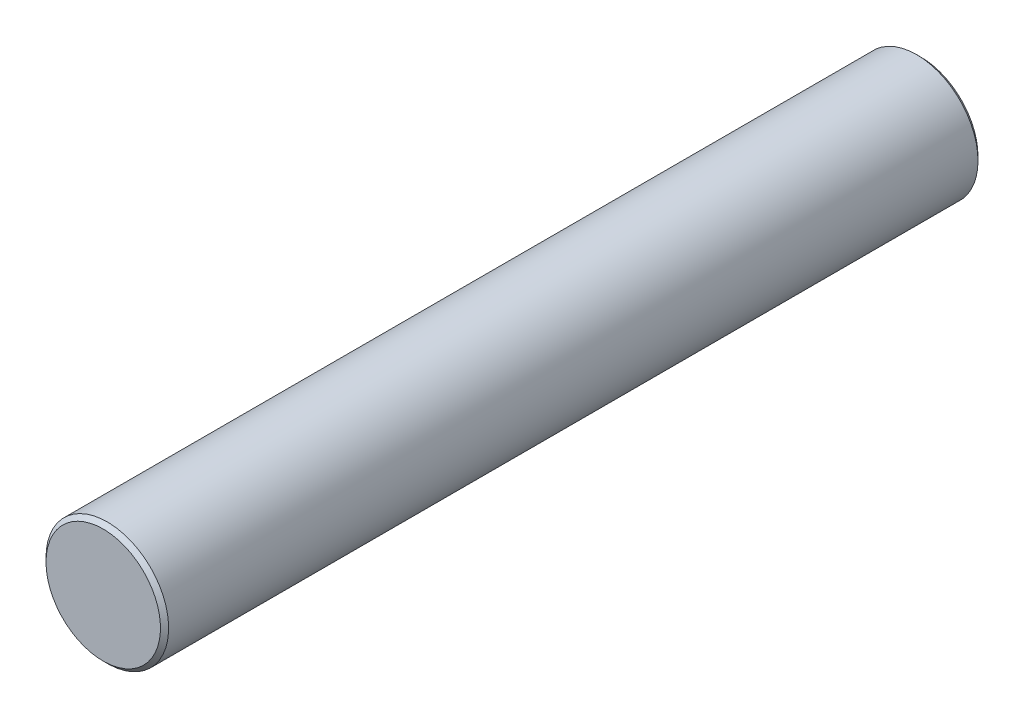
ISO-10303-21;
HEADER;
FILE_DESCRIPTION(('STEP AP214'),'2;1');
FILE_NAME('part.step','',(''),(''),'','','');
FILE_SCHEMA(('AUTOMOTIVE_DESIGN { 1 0 10303 214 1 1 1 1 }'));
ENDSEC;
DATA;
#1=APPLICATION_CONTEXT('core data for automotive mechanical design processes');
#2=APPLICATION_PROTOCOL_DEFINITION('international standard','automotive_design',2000,#1);
#3=PRODUCT_CONTEXT('',#1,'mechanical');
#4=PRODUCT('Part','Part','',(#3));
#5=PRODUCT_RELATED_PRODUCT_CATEGORY('part','',(#4));
#6=PRODUCT_DEFINITION_FORMATION('','',#4);
#7=PRODUCT_DEFINITION_CONTEXT('part definition',#1,'design');
#8=PRODUCT_DEFINITION('design','',#6,#7);
#9=PRODUCT_DEFINITION_SHAPE('','',#8);
#10=(LENGTH_UNIT() NAMED_UNIT(*) SI_UNIT(.MILLI.,.METRE.));
#11=(NAMED_UNIT(*) PLANE_ANGLE_UNIT() SI_UNIT($,.RADIAN.));
#12=(NAMED_UNIT(*) SI_UNIT($,.STERADIAN.) SOLID_ANGLE_UNIT());
#13=UNCERTAINTY_MEASURE_WITH_UNIT(LENGTH_MEASURE(1.E-05),#10,'distance_accuracy_value','');
#14=(GEOMETRIC_REPRESENTATION_CONTEXT(3) GLOBAL_UNCERTAINTY_ASSIGNED_CONTEXT((#13)) GLOBAL_UNIT_ASSIGNED_CONTEXT((#10,
#11,#12)) REPRESENTATION_CONTEXT('',''));
#15=CARTESIAN_POINT('',(0.,0.,0.));
#16=DIRECTION('',(0.,0.,1.));
#17=DIRECTION('',(1.,0.,0.));
#18=AXIS2_PLACEMENT_3D('',#15,#16,#17);
#19=CARTESIAN_POINT('',(0.,0.,9.99999999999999));
#20=DIRECTION('',(0.,0.,-0.999999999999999));
#21=DIRECTION('',(-1.,0.,0.));
#22=AXIS2_PLACEMENT_3D('',#19,#20,#21);
#23=CYLINDRICAL_SURFACE('',#22,1.5);
#24=CARTESIAN_POINT('',(0.,0.,-9.89999999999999));
#25=DIRECTION('',(0.,0.,0.999999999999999));
#26=DIRECTION('',(1.,0.,0.));
#27=AXIS2_PLACEMENT_3D('',#24,#25,#26);
#28=CIRCLE('',#27,1.5);
#29=CARTESIAN_POINT('',(-1.5,0.,-9.89999999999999));
#30=VERTEX_POINT('',#29);
#31=EDGE_CURVE('E38',#30,#30,#28,.T.);
#32=CARTESIAN_POINT('',(0.,0.,9.89999999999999));
#33=DIRECTION('',(0.,0.,0.999999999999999));
#34=DIRECTION('',(1.,0.,0.));
#35=AXIS2_PLACEMENT_3D('',#32,#33,#34);
#36=CIRCLE('',#35,1.5);
#37=CARTESIAN_POINT('',(-1.5,0.,9.89999999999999));
#38=VERTEX_POINT('',#37);
#39=EDGE_CURVE('E42',#38,#38,#36,.F.);
#40=CARTESIAN_POINT('',(-1.5,0.,-9.89999999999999));
#41=CARTESIAN_POINT('',(-1.5,0.,-9.69374999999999));
#42=CARTESIAN_POINT('',(-1.5,0.,-9.48749999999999));
#43=CARTESIAN_POINT('',(-1.5,0.,-9.07499999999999));
#44=CARTESIAN_POINT('',(-1.5,0.,-8.86874999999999));
#45=CARTESIAN_POINT('',(-1.5,0.,-8.45624999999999));
#46=CARTESIAN_POINT('',(-1.5,0.,-8.24999999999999));
#47=CARTESIAN_POINT('',(-1.5,0.,-7.8375));
#48=CARTESIAN_POINT('',(-1.5,0.,-7.63125));
#49=CARTESIAN_POINT('',(-1.5,0.,-7.21875));
#50=CARTESIAN_POINT('',(-1.5,0.,-7.0125));
#51=CARTESIAN_POINT('',(-1.5,0.,-6.6));
#52=CARTESIAN_POINT('',(-1.5,0.,-6.39375));
#53=CARTESIAN_POINT('',(-1.5,0.,-5.98124999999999));
#54=CARTESIAN_POINT('',(-1.5,0.,-5.775));
#55=CARTESIAN_POINT('',(-1.5,0.,-5.3625));
#56=CARTESIAN_POINT('',(-1.5,0.,-5.15625));
#57=CARTESIAN_POINT('',(-1.5,0.,-4.74375));
#58=CARTESIAN_POINT('',(-1.5,0.,-4.5375));
#59=CARTESIAN_POINT('',(-1.5,0.,-4.125));
#60=CARTESIAN_POINT('',(-1.5,0.,-3.91875));
#61=CARTESIAN_POINT('',(-1.5,0.,-3.50625));
#62=CARTESIAN_POINT('',(-1.5,0.,-3.3));
#63=CARTESIAN_POINT('',(-1.5,0.,-2.8875));
#64=CARTESIAN_POINT('',(-1.5,0.,-2.68125));
#65=CARTESIAN_POINT('',(-1.5,0.,-2.26875));
#66=CARTESIAN_POINT('',(-1.5,0.,-2.0625));
#67=CARTESIAN_POINT('',(-1.5,0.,-1.65));
#68=CARTESIAN_POINT('',(-1.5,0.,-1.44375));
#69=CARTESIAN_POINT('',(-1.5,0.,-1.03125));
#70=CARTESIAN_POINT('',(-1.5,0.,-0.824999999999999));
#71=CARTESIAN_POINT('',(-1.5,0.,-0.4125));
#72=CARTESIAN_POINT('',(-1.5,0.,-0.20625));
#73=CARTESIAN_POINT('',(-1.5,0.,0.20625));
#74=CARTESIAN_POINT('',(-1.5,0.,0.4125));
#75=CARTESIAN_POINT('',(-1.5,0.,0.824999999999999));
#76=CARTESIAN_POINT('',(-1.5,0.,1.03125));
#77=CARTESIAN_POINT('',(-1.5,0.,1.44375));
#78=CARTESIAN_POINT('',(-1.5,0.,1.65));
#79=CARTESIAN_POINT('',(-1.5,0.,2.0625));
#80=CARTESIAN_POINT('',(-1.5,0.,2.26875));
#81=CARTESIAN_POINT('',(-1.5,0.,2.68125));
#82=CARTESIAN_POINT('',(-1.5,0.,2.8875));
#83=CARTESIAN_POINT('',(-1.5,0.,3.3));
#84=CARTESIAN_POINT('',(-1.5,0.,3.50625));
#85=CARTESIAN_POINT('',(-1.5,0.,3.91875));
#86=CARTESIAN_POINT('',(-1.5,0.,4.125));
#87=CARTESIAN_POINT('',(-1.5,0.,4.5375));
#88=CARTESIAN_POINT('',(-1.5,0.,4.74375));
#89=CARTESIAN_POINT('',(-1.5,0.,5.15625));
#90=CARTESIAN_POINT('',(-1.5,0.,5.36249999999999));
#91=CARTESIAN_POINT('',(-1.5,0.,5.77499999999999));
#92=CARTESIAN_POINT('',(-1.5,0.,5.98124999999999));
#93=CARTESIAN_POINT('',(-1.5,0.,6.39374999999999));
#94=CARTESIAN_POINT('',(-1.5,0.,6.59999999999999));
#95=CARTESIAN_POINT('',(-1.5,0.,7.0125));
#96=CARTESIAN_POINT('',(-1.5,0.,7.21875));
#97=CARTESIAN_POINT('',(-1.5,0.,7.63125));
#98=CARTESIAN_POINT('',(-1.5,0.,7.83749999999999));
#99=CARTESIAN_POINT('',(-1.5,0.,8.24999999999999));
#100=CARTESIAN_POINT('',(-1.5,0.,8.45624999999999));
#101=CARTESIAN_POINT('',(-1.5,0.,8.86874999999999));
#102=CARTESIAN_POINT('',(-1.5,0.,9.07499999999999));
#103=CARTESIAN_POINT('',(-1.5,0.,9.48749999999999));
#104=CARTESIAN_POINT('',(-1.5,0.,9.69374999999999));
#105=CARTESIAN_POINT('',(-1.5,0.,9.89999999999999));
#106=B_SPLINE_CURVE_WITH_KNOTS('',3,(#40,#41,#42,#43,#44,#45,#46,#47,#48,#49,#50,#51,#52,#53,
#54,#55,#56,#57,#58,#59,#60,#61,#62,#63,#64,#65,#66,#67,#68,#69,#70,#71,#72,#73,#74,#75,#76,#77,
#78,#79,#80,#81,#82,#83,#84,#85,#86,#87,#88,#89,#90,#91,#92,#93,#94,#95,#96,#97,#98,#99,#100,
#101,#102,#103,#104,#105),.UNSPECIFIED.,.F.,.F.,(4,2,2,2,2,2,2,2,2,2,2,2,2,2,2,2,2,2,2,2,2,2,2,
2,2,2,2,2,2,2,2,2,4),(0.,0.618750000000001,1.2375,1.85625,2.47499999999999,3.09375,3.7125,
4.33125,4.95,5.56875,6.18749999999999,6.80625,7.42499999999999,8.04374999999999,
8.66249999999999,9.28124999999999,9.89999999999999,10.51875,11.1375,11.75625,12.375,12.99375,
13.6125,14.23125,14.85,15.46875,16.0875,16.70625,17.325,17.94375,18.5625,19.18125,19.8),.UNSPECIFIED.);
#107=EDGE_CURVE('BSEAM28',#30,#38,#106,.T.);
#108=ORIENTED_EDGE('',*,*,#31,.T.);
#109=ORIENTED_EDGE('',*,*,#39,.T.);
#110=ORIENTED_EDGE('',*,*,#107,.T.);
#111=ORIENTED_EDGE('',*,*,#107,.F.);
#112=EDGE_LOOP('',(#108,#110,#109,#111));
#113=FACE_BOUND('',#112,.T.);
#114=ADVANCED_FACE('F28',(#113),#23,.T.);
#115=CARTESIAN_POINT('',(0.,0.,9.99999999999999));
#116=DIRECTION('',(0.,0.,0.999999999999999));
#117=DIRECTION('',(1.,0.,0.));
#118=AXIS2_PLACEMENT_3D('',#115,#116,#117);
#119=PLANE('',#118);
#120=CARTESIAN_POINT('',(0.,0.,9.99999999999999));
#121=DIRECTION('',(0.,0.,0.999999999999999));
#122=DIRECTION('',(1.,0.,0.));
#123=AXIS2_PLACEMENT_3D('',#120,#121,#122);
#124=CIRCLE('',#123,1.4);
#125=CARTESIAN_POINT('',(-1.4,0.,9.99999999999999));
#126=VERTEX_POINT('',#125);
#127=EDGE_CURVE('E10',#126,#126,#124,.T.);
#128=ORIENTED_EDGE('',*,*,#127,.T.);
#129=EDGE_LOOP('',(#128));
#130=FACE_BOUND('',#129,.T.);
#131=ADVANCED_FACE('F61',(#130),#119,.T.);
#132=CARTESIAN_POINT('',(0.,0.,-9.99999999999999));
#133=DIRECTION('',(0.,0.,0.999999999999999));
#134=DIRECTION('',(1.,0.,0.));
#135=AXIS2_PLACEMENT_3D('',#132,#133,#134);
#136=PLANE('',#135);
#137=CARTESIAN_POINT('',(0.,0.,-9.99999999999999));
#138=DIRECTION('',(0.,0.,0.999999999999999));
#139=DIRECTION('',(1.,0.,0.));
#140=AXIS2_PLACEMENT_3D('',#137,#138,#139);
#141=CIRCLE('',#140,1.4);
#142=CARTESIAN_POINT('',(1.4,0.,-9.99999999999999));
#143=VERTEX_POINT('',#142);
#144=EDGE_CURVE('E34',#143,#143,#141,.F.);
#145=ORIENTED_EDGE('',*,*,#144,.T.);
#146=EDGE_LOOP('',(#145));
#147=FACE_BOUND('',#146,.T.);
#148=ADVANCED_FACE('F57',(#147),#136,.F.);
#149=CARTESIAN_POINT('',(0.,0.,-9.89999999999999));
#150=DIRECTION('',(0.,0.,0.999999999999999));
#151=DIRECTION('',(1.,0.,0.));
#152=AXIS2_PLACEMENT_3D('',#149,#150,#151);
#153=CONICAL_SURFACE('',#152,1.5,0.78539816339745);
#154=ORIENTED_EDGE('',*,*,#144,.F.);
#155=EDGE_LOOP('',(#154));
#156=FACE_BOUND('',#155,.T.);
#157=ORIENTED_EDGE('',*,*,#31,.F.);
#158=EDGE_LOOP('',(#157));
#159=FACE_BOUND('',#158,.T.);
#160=ADVANCED_FACE('F52',(#156,#159),#153,.T.);
#161=CARTESIAN_POINT('',(0.,0.,9.99999999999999));
#162=DIRECTION('',(0.,0.,-0.999999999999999));
#163=DIRECTION('',(-1.,0.,0.));
#164=AXIS2_PLACEMENT_3D('',#161,#162,#163);
#165=CONICAL_SURFACE('',#164,1.4,0.785398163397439);
#166=CARTESIAN_POINT('',(-1.5,0.,9.89999999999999));
#167=CARTESIAN_POINT('',(-1.49895833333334,0.,9.90104166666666));
#168=CARTESIAN_POINT('',(-1.49791666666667,0.,9.90208333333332));
#169=CARTESIAN_POINT('',(-1.49583333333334,0.,9.90416666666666));
#170=CARTESIAN_POINT('',(-1.49479166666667,0.,9.90520833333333));
#171=CARTESIAN_POINT('',(-1.49270833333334,0.,9.90729166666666));
#172=CARTESIAN_POINT('',(-1.49166666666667,0.,9.90833333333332));
#173=CARTESIAN_POINT('',(-1.48958333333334,0.,9.91041666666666));
#174=CARTESIAN_POINT('',(-1.48854166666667,0.,9.91145833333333));
#175=CARTESIAN_POINT('',(-1.48645833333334,0.,9.91354166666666));
#176=CARTESIAN_POINT('',(-1.48541666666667,0.,9.91458333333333));
#177=CARTESIAN_POINT('',(-1.48333333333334,0.,9.91666666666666));
#178=CARTESIAN_POINT('',(-1.48229166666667,0.,9.91770833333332));
#179=CARTESIAN_POINT('',(-1.48020833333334,0.,9.91979166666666));
#180=CARTESIAN_POINT('',(-1.47916666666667,0.,9.92083333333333));
#181=CARTESIAN_POINT('',(-1.47708333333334,0.,9.92291666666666));
#182=CARTESIAN_POINT('',(-1.47604166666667,0.,9.92395833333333));
#183=CARTESIAN_POINT('',(-1.47395833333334,0.,9.92604166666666));
#184=CARTESIAN_POINT('',(-1.47291666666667,0.,9.92708333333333));
#185=CARTESIAN_POINT('',(-1.47083333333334,0.,9.92916666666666));
#186=CARTESIAN_POINT('',(-1.46979166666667,0.,9.93020833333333));
#187=CARTESIAN_POINT('',(-1.46770833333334,0.,9.93229166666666));
#188=CARTESIAN_POINT('',(-1.46666666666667,0.,9.93333333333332));
#189=CARTESIAN_POINT('',(-1.46458333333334,0.,9.93541666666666));
#190=CARTESIAN_POINT('',(-1.46354166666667,0.,9.93645833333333));
#191=CARTESIAN_POINT('',(-1.46145833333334,0.,9.93854166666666));
#192=CARTESIAN_POINT('',(-1.46041666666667,0.,9.93958333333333));
#193=CARTESIAN_POINT('',(-1.45833333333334,0.,9.94166666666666));
#194=CARTESIAN_POINT('',(-1.45729166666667,0.,9.94270833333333));
#195=CARTESIAN_POINT('',(-1.45520833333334,0.,9.94479166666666));
#196=CARTESIAN_POINT('',(-1.45416666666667,0.,9.94583333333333));
#197=CARTESIAN_POINT('',(-1.45208333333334,0.,9.94791666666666));
#198=CARTESIAN_POINT('',(-1.45104166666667,0.,9.94895833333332));
#199=CARTESIAN_POINT('',(-1.44895833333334,0.,9.95104166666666));
#200=CARTESIAN_POINT('',(-1.44791666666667,0.,9.95208333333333));
#201=CARTESIAN_POINT('',(-1.44583333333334,0.,9.95416666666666));
#202=CARTESIAN_POINT('',(-1.44479166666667,0.,9.95520833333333));
#203=CARTESIAN_POINT('',(-1.44270833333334,0.,9.95729166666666));
#204=CARTESIAN_POINT('',(-1.44166666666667,0.,9.95833333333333));
#205=CARTESIAN_POINT('',(-1.43958333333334,0.,9.96041666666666));
#206=CARTESIAN_POINT('',(-1.43854166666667,0.,9.96145833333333));
#207=CARTESIAN_POINT('',(-1.43645833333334,0.,9.96354166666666));
#208=CARTESIAN_POINT('',(-1.43541666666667,0.,9.96458333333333));
#209=CARTESIAN_POINT('',(-1.43333333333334,0.,9.96666666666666));
#210=CARTESIAN_POINT('',(-1.43229166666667,0.,9.96770833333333));
#211=CARTESIAN_POINT('',(-1.43020833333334,0.,9.96979166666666));
#212=CARTESIAN_POINT('',(-1.42916666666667,0.,9.97083333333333));
#213=CARTESIAN_POINT('',(-1.42708333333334,0.,9.97291666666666));
#214=CARTESIAN_POINT('',(-1.42604166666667,0.,9.97395833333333));
#215=CARTESIAN_POINT('',(-1.42395833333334,0.,9.97604166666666));
#216=CARTESIAN_POINT('',(-1.42291666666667,0.,9.97708333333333));
#217=CARTESIAN_POINT('',(-1.42083333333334,0.,9.97916666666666));
#218=CARTESIAN_POINT('',(-1.41979166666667,0.,9.98020833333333));
#219=CARTESIAN_POINT('',(-1.41770833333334,0.,9.98229166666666));
#220=CARTESIAN_POINT('',(-1.41666666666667,0.,9.98333333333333));
#221=CARTESIAN_POINT('',(-1.41458333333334,0.,9.98541666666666));
#222=CARTESIAN_POINT('',(-1.41354166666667,0.,9.98645833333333));
#223=CARTESIAN_POINT('',(-1.41145833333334,0.,9.98854166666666));
#224=CARTESIAN_POINT('',(-1.41041666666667,0.,9.98958333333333));
#225=CARTESIAN_POINT('',(-1.40833333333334,0.,9.99166666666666));
#226=CARTESIAN_POINT('',(-1.40729166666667,0.,9.99270833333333));
#227=CARTESIAN_POINT('',(-1.40520833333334,0.,9.99479166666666));
#228=CARTESIAN_POINT('',(-1.40416666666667,0.,9.99583333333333));
#229=CARTESIAN_POINT('',(-1.40208333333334,0.,9.99791666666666));
#230=CARTESIAN_POINT('',(-1.40104166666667,0.,9.99895833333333));
#231=CARTESIAN_POINT('',(-1.4,0.,9.99999999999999));
#232=B_SPLINE_CURVE_WITH_KNOTS('',3,(#166,#167,#168,#169,#170,#171,#172,#173,#174,#175,#176,
#177,#178,#179,#180,#181,#182,#183,#184,#185,#186,#187,#188,#189,#190,#191,#192,#193,#194,#195,
#196,#197,#198,#199,#200,#201,#202,#203,#204,#205,#206,#207,#208,#209,#210,#211,#212,#213,#214,
#215,#216,#217,#218,#219,#220,#221,#222,#223,#224,#225,#226,#227,#228,#229,#230,#231),
.UNSPECIFIED.,.F.,.F.,(4,2,2,2,2,2,2,2,2,2,2,2,2,2,2,2,2,2,2,2,2,2,2,2,2,2,2,2,2,2,2,2,4),(0.,
0.00441941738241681,0.00883883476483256,0.0132582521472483,0.017677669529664,0.0220970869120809,
0.0265165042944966,0.0309359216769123,0.0353553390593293,0.0397747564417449,0.0441941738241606,
0.0486135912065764,0.053033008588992,0.0574524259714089,0.0618718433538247,0.0662912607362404,
0.070710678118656,0.075130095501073,0.0795495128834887,0.0839689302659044,0.08838834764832,
0.092807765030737,0.0972271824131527,0.101646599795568,0.106066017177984,0.110485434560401,
0.114904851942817,0.119324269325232,0.123743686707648,0.128163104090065,0.132582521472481,
0.137001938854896,0.141421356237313),.UNSPECIFIED.);
#233=EDGE_CURVE('BSEAM49',#38,#126,#232,.T.);
#234=ORIENTED_EDGE('',*,*,#39,.F.);
#235=ORIENTED_EDGE('',*,*,#127,.F.);
#236=ORIENTED_EDGE('',*,*,#233,.T.);
#237=ORIENTED_EDGE('',*,*,#233,.F.);
#238=EDGE_LOOP('',(#234,#236,#235,#237));
#239=FACE_BOUND('',#238,.T.);
#240=ADVANCED_FACE('F49',(#239),#165,.T.);
#241=CLOSED_SHELL('',(#114,#131,#148,#160,#240));
#242=MANIFOLD_SOLID_BREP('B2',#241);
#243=ADVANCED_BREP_SHAPE_REPRESENTATION('',(#18,#242),#14);
#244=SHAPE_DEFINITION_REPRESENTATION(#9,#243);
ENDSEC;
END-ISO-10303-21;
